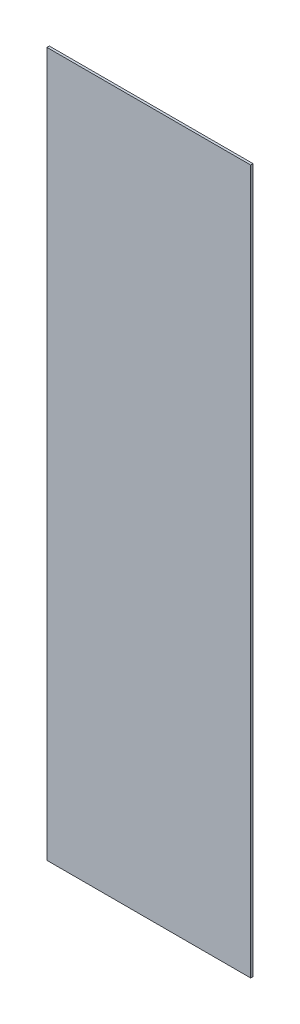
ISO-10303-21;
HEADER;
FILE_DESCRIPTION(('STEP AP214'),'2;1');
FILE_NAME('part.step','',(''),(''),'','','');
FILE_SCHEMA(('AUTOMOTIVE_DESIGN { 1 0 10303 214 1 1 1 1 }'));
ENDSEC;
DATA;
#1=APPLICATION_CONTEXT('core data for automotive mechanical design processes');
#2=APPLICATION_PROTOCOL_DEFINITION('international standard','automotive_design',2000,#1);
#3=PRODUCT_CONTEXT('',#1,'mechanical');
#4=PRODUCT('Part','Part','',(#3));
#5=PRODUCT_RELATED_PRODUCT_CATEGORY('part','',(#4));
#6=PRODUCT_DEFINITION_FORMATION('','',#4);
#7=PRODUCT_DEFINITION_CONTEXT('part definition',#1,'design');
#8=PRODUCT_DEFINITION('design','',#6,#7);
#9=PRODUCT_DEFINITION_SHAPE('','',#8);
#10=(LENGTH_UNIT() NAMED_UNIT(*) SI_UNIT(.MILLI.,.METRE.));
#11=(NAMED_UNIT(*) PLANE_ANGLE_UNIT() SI_UNIT($,.RADIAN.));
#12=(NAMED_UNIT(*) SI_UNIT($,.STERADIAN.) SOLID_ANGLE_UNIT());
#13=UNCERTAINTY_MEASURE_WITH_UNIT(LENGTH_MEASURE(1.E-05),#10,'distance_accuracy_value','');
#14=(GEOMETRIC_REPRESENTATION_CONTEXT(3) GLOBAL_UNCERTAINTY_ASSIGNED_CONTEXT((#13)) GLOBAL_UNIT_ASSIGNED_CONTEXT((#10,
#11,#12)) REPRESENTATION_CONTEXT('',''));
#15=CARTESIAN_POINT('',(0.,0.,0.));
#16=DIRECTION('',(0.,0.,1.));
#17=DIRECTION('',(1.,0.,0.));
#18=AXIS2_PLACEMENT_3D('',#15,#16,#17);
#19=CARTESIAN_POINT('',(0.,0.,4.));
#20=DIRECTION('',(1.,0.,0.));
#21=DIRECTION('',(0.,0.,-1.));
#22=AXIS2_PLACEMENT_3D('',#19,#20,#21);
#23=PLANE('',#22);
#24=DIRECTION('',(0.,-1.,0.));
#25=VECTOR('',#24,1.);
#26=CARTESIAN_POINT('',(0.,0.,0.));
#27=LINE('',#26,#25);
#28=CARTESIAN_POINT('',(0.,1175.,0.));
#29=VERTEX_POINT('',#28);
#30=CARTESIAN_POINT('',(0.,0.,0.));
#31=VERTEX_POINT('',#30);
#32=EDGE_CURVE('E96',#29,#31,#27,.T.);
#33=ORIENTED_EDGE('',*,*,#32,.T.);
#34=DIRECTION('',(0.,0.,-1.));
#35=VECTOR('',#34,1.);
#36=CARTESIAN_POINT('',(0.,0.,4.));
#37=LINE('',#36,#35);
#38=CARTESIAN_POINT('',(0.,0.,4.));
#39=VERTEX_POINT('',#38);
#40=EDGE_CURVE('E11',#39,#31,#37,.T.);
#41=ORIENTED_EDGE('',*,*,#40,.F.);
#42=DIRECTION('',(0.,-1.,0.));
#43=VECTOR('',#42,1.);
#44=CARTESIAN_POINT('',(0.,0.,4.));
#45=LINE('',#44,#43);
#46=CARTESIAN_POINT('',(0.,1175.,4.));
#47=VERTEX_POINT('',#46);
#48=EDGE_CURVE('E84',#47,#39,#45,.T.);
#49=ORIENTED_EDGE('',*,*,#48,.F.);
#50=DIRECTION('',(0.,0.,-1.));
#51=VECTOR('',#50,1.);
#52=CARTESIAN_POINT('',(0.,1175.,4.));
#53=LINE('',#52,#51);
#54=EDGE_CURVE('E92',#47,#29,#53,.T.);
#55=ORIENTED_EDGE('',*,*,#54,.T.);
#56=EDGE_LOOP('',(#33,#41,#49,#55));
#57=FACE_BOUND('',#56,.T.);
#58=ADVANCED_FACE('F33',(#57),#23,.F.);
#59=CARTESIAN_POINT('',(0.,0.,4.));
#60=DIRECTION('',(0.,1.,0.));
#61=DIRECTION('',(0.,0.,1.));
#62=AXIS2_PLACEMENT_3D('',#59,#60,#61);
#63=PLANE('',#62);
#64=DIRECTION('',(1.,0.,0.));
#65=VECTOR('',#64,1.);
#66=CARTESIAN_POINT('',(0.,0.,0.));
#67=LINE('',#66,#65);
#68=CARTESIAN_POINT('',(340.,0.,0.));
#69=VERTEX_POINT('',#68);
#70=EDGE_CURVE('E88',#31,#69,#67,.T.);
#71=ORIENTED_EDGE('',*,*,#70,.T.);
#72=DIRECTION('',(0.,0.,-1.));
#73=VECTOR('',#72,1.);
#74=CARTESIAN_POINT('',(340.,0.,4.));
#75=LINE('',#74,#73);
#76=CARTESIAN_POINT('',(340.,0.,4.));
#77=VERTEX_POINT('',#76);
#78=EDGE_CURVE('E41',#77,#69,#75,.T.);
#79=ORIENTED_EDGE('',*,*,#78,.F.);
#80=DIRECTION('',(1.,0.,0.));
#81=VECTOR('',#80,1.);
#82=CARTESIAN_POINT('',(0.,0.,4.));
#83=LINE('',#82,#81);
#84=EDGE_CURVE('E79',#39,#77,#83,.T.);
#85=ORIENTED_EDGE('',*,*,#84,.F.);
#86=ORIENTED_EDGE('',*,*,#40,.T.);
#87=EDGE_LOOP('',(#71,#79,#85,#86));
#88=FACE_BOUND('',#87,.T.);
#89=ADVANCED_FACE('F87',(#88),#63,.F.);
#90=CARTESIAN_POINT('',(340.,0.,4.));
#91=DIRECTION('',(-1.,0.,0.));
#92=DIRECTION('',(0.,0.,1.));
#93=AXIS2_PLACEMENT_3D('',#90,#91,#92);
#94=PLANE('',#93);
#95=DIRECTION('',(0.,1.,0.));
#96=VECTOR('',#95,1.);
#97=CARTESIAN_POINT('',(340.,0.,0.));
#98=LINE('',#97,#96);
#99=CARTESIAN_POINT('',(340.,1175.,0.));
#100=VERTEX_POINT('',#99);
#101=EDGE_CURVE('E66',#69,#100,#98,.T.);
#102=ORIENTED_EDGE('',*,*,#101,.T.);
#103=DIRECTION('',(0.,0.,-1.));
#104=VECTOR('',#103,1.);
#105=CARTESIAN_POINT('',(340.,1175.,4.));
#106=LINE('',#105,#104);
#107=CARTESIAN_POINT('',(340.,1175.,4.));
#108=VERTEX_POINT('',#107);
#109=EDGE_CURVE('E89',#108,#100,#106,.T.);
#110=ORIENTED_EDGE('',*,*,#109,.F.);
#111=DIRECTION('',(0.,1.,0.));
#112=VECTOR('',#111,1.);
#113=CARTESIAN_POINT('',(340.,0.,4.));
#114=LINE('',#113,#112);
#115=EDGE_CURVE('E82',#77,#108,#114,.T.);
#116=ORIENTED_EDGE('',*,*,#115,.F.);
#117=ORIENTED_EDGE('',*,*,#78,.T.);
#118=EDGE_LOOP('',(#102,#110,#116,#117));
#119=FACE_BOUND('',#118,.T.);
#120=ADVANCED_FACE('F90',(#119),#94,.F.);
#121=CARTESIAN_POINT('',(0.,1175.,4.));
#122=DIRECTION('',(0.,-1.,0.));
#123=DIRECTION('',(1.,0.,0.));
#124=AXIS2_PLACEMENT_3D('',#121,#122,#123);
#125=PLANE('',#124);
#126=DIRECTION('',(-1.,0.,0.));
#127=VECTOR('',#126,1.);
#128=CARTESIAN_POINT('',(0.,1175.,0.));
#129=LINE('',#128,#127);
#130=EDGE_CURVE('E72',#100,#29,#129,.T.);
#131=ORIENTED_EDGE('',*,*,#130,.T.);
#132=ORIENTED_EDGE('',*,*,#54,.F.);
#133=DIRECTION('',(-1.,0.,0.));
#134=VECTOR('',#133,1.);
#135=CARTESIAN_POINT('',(0.,1175.,4.));
#136=LINE('',#135,#134);
#137=EDGE_CURVE('E49',#108,#47,#136,.T.);
#138=ORIENTED_EDGE('',*,*,#137,.F.);
#139=ORIENTED_EDGE('',*,*,#109,.T.);
#140=EDGE_LOOP('',(#131,#132,#138,#139));
#141=FACE_BOUND('',#140,.T.);
#142=ADVANCED_FACE('F103',(#141),#125,.F.);
#143=CARTESIAN_POINT('',(0.,1175.,4.));
#144=DIRECTION('',(0.,0.,-1.));
#145=DIRECTION('',(-1.,0.,0.));
#146=AXIS2_PLACEMENT_3D('',#143,#144,#145);
#147=PLANE('',#146);
#148=ORIENTED_EDGE('',*,*,#48,.T.);
#149=ORIENTED_EDGE('',*,*,#84,.T.);
#150=ORIENTED_EDGE('',*,*,#115,.T.);
#151=ORIENTED_EDGE('',*,*,#137,.T.);
#152=EDGE_LOOP('',(#148,#149,#150,#151));
#153=FACE_BOUND('',#152,.T.);
#154=ADVANCED_FACE('F80',(#153),#147,.F.);
#155=CARTESIAN_POINT('',(0.,1175.,0.));
#156=DIRECTION('',(0.,0.,-1.));
#157=DIRECTION('',(-1.,0.,0.));
#158=AXIS2_PLACEMENT_3D('',#155,#156,#157);
#159=PLANE('',#158);
#160=ORIENTED_EDGE('',*,*,#32,.F.);
#161=ORIENTED_EDGE('',*,*,#130,.F.);
#162=ORIENTED_EDGE('',*,*,#101,.F.);
#163=ORIENTED_EDGE('',*,*,#70,.F.);
#164=EDGE_LOOP('',(#160,#161,#162,#163));
#165=FACE_BOUND('',#164,.T.);
#166=ADVANCED_FACE('F106',(#165),#159,.T.);
#167=CLOSED_SHELL('',(#58,#89,#120,#142,#154,#166));
#168=MANIFOLD_SOLID_BREP('B2',#167);
#169=ADVANCED_BREP_SHAPE_REPRESENTATION('',(#18,#168),#14);
#170=SHAPE_DEFINITION_REPRESENTATION(#9,#169);
ENDSEC;
END-ISO-10303-21;
